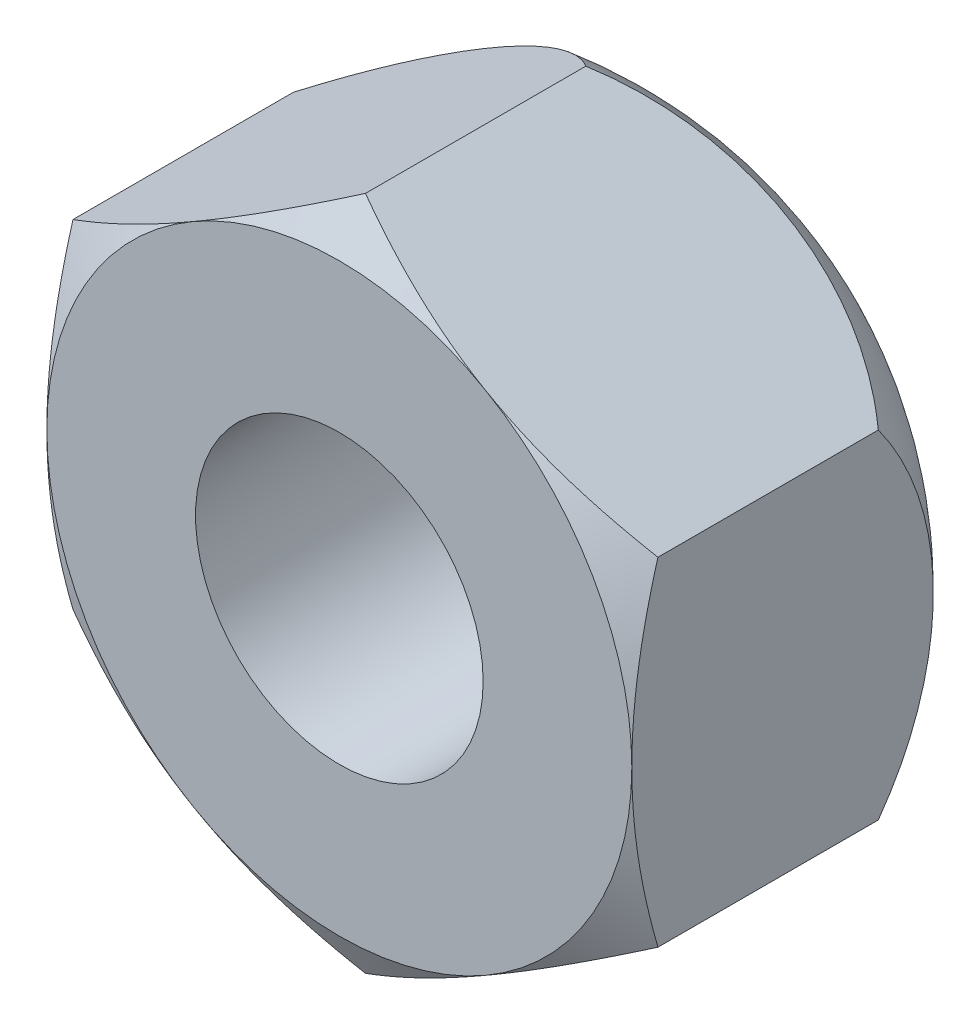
ISO-10303-21;
HEADER;
FILE_DESCRIPTION(('STEP AP214'),'2;1');
FILE_NAME('part.step','',(''),(''),'','','');
FILE_SCHEMA(('AUTOMOTIVE_DESIGN { 1 0 10303 214 1 1 1 1 }'));
ENDSEC;
DATA;
#1=APPLICATION_CONTEXT('core data for automotive mechanical design processes');
#2=APPLICATION_PROTOCOL_DEFINITION('international standard','automotive_design',2000,#1);
#3=PRODUCT_CONTEXT('',#1,'mechanical');
#4=PRODUCT('Part','Part','',(#3));
#5=PRODUCT_RELATED_PRODUCT_CATEGORY('part','',(#4));
#6=PRODUCT_DEFINITION_FORMATION('','',#4);
#7=PRODUCT_DEFINITION_CONTEXT('part definition',#1,'design');
#8=PRODUCT_DEFINITION('design','',#6,#7);
#9=PRODUCT_DEFINITION_SHAPE('','',#8);
#10=(LENGTH_UNIT() NAMED_UNIT(*) SI_UNIT(.MILLI.,.METRE.));
#11=(NAMED_UNIT(*) PLANE_ANGLE_UNIT() SI_UNIT($,.RADIAN.));
#12=(NAMED_UNIT(*) SI_UNIT($,.STERADIAN.) SOLID_ANGLE_UNIT());
#13=UNCERTAINTY_MEASURE_WITH_UNIT(LENGTH_MEASURE(1.E-05),#10,'distance_accuracy_value','');
#14=(GEOMETRIC_REPRESENTATION_CONTEXT(3) GLOBAL_UNCERTAINTY_ASSIGNED_CONTEXT((#13)) GLOBAL_UNIT_ASSIGNED_CONTEXT((#10,
#11,#12)) REPRESENTATION_CONTEXT('',''));
#15=CARTESIAN_POINT('',(0.,0.,0.));
#16=DIRECTION('',(0.,0.,1.));
#17=DIRECTION('',(1.,0.,0.));
#18=AXIS2_PLACEMENT_3D('',#15,#16,#17);
#19=CARTESIAN_POINT('',(28.,26.8301270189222,-46.));
#20=DIRECTION('',(0.500000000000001,0.866025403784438,0.));
#21=DIRECTION('',(-0.866025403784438,0.500000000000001,0.));
#22=AXIS2_PLACEMENT_3D('',#19,#20,#21);
#23=PLANE('',#22);
#24=CARTESIAN_POINT('',(28.000000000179,26.8301270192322,-43.0000000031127));
#25=CARTESIAN_POINT('',(27.8938890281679,26.8913902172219,-42.9999795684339));
#26=CARTESIAN_POINT('',(27.7877831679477,26.9526504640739,-43.0025997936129));
#27=CARTESIAN_POINT('',(27.5757797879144,27.0750506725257,-43.0129696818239));
#28=CARTESIAN_POINT('',(27.4698822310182,27.1361906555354,-43.0207183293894));
#29=CARTESIAN_POINT('',(27.2589794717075,27.2579554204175,-43.0411421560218));
#30=CARTESIAN_POINT('',(27.153972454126,27.3185812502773,-43.0537925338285));
#31=CARTESIAN_POINT('',(26.9444587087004,27.4395440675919,-43.083747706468));
#32=CARTESIAN_POINT('',(26.8399519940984,27.4998810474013,-43.1010526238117));
#33=CARTESIAN_POINT('',(26.5276154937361,27.6802086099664,-43.1594145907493));
#34=CARTESIAN_POINT('',(26.3206930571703,27.799675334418,-43.2069471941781));
#35=CARTESIAN_POINT('',(25.9086276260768,28.0375814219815,-43.3165695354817));
#36=CARTESIAN_POINT('',(25.7034990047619,28.156012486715,-43.3787319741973));
#37=CARTESIAN_POINT('',(25.50000007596,28.2735026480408,-43.4465819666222));
#38=B_SPLINE_CURVE_WITH_KNOTS('',3,(#24,#25,#26,#27,#28,#29,#30,#31,#32,#33,#34,#35,#36,#37),
.UNSPECIFIED.,.F.,.F.,(4,2,2,2,2,2,4),(0.,0.367541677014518,0.735010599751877,1.10064402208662,
1.46628706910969,2.1966148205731,2.93065145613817),.UNSPECIFIED.);
#39=CARTESIAN_POINT('',(27.999999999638,26.8301270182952,-43.0000000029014));
#40=VERTEX_POINT('',#39);
#41=CARTESIAN_POINT('',(25.5000000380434,28.2735026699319,-43.446581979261));
#42=VERTEX_POINT('',#41);
#43=EDGE_CURVE('E166',#40,#42,#38,.T.);
#44=ORIENTED_EDGE('',*,*,#43,.F.);
#45=CARTESIAN_POINT('',(30.5000000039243,25.3867513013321,-43.4465820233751));
#46=CARTESIAN_POINT('',(30.2965010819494,25.5042414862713,-43.3787320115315));
#47=CARTESIAN_POINT('',(30.0913724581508,25.6226725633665,-43.3165695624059));
#48=CARTESIAN_POINT('',(29.6793070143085,25.8605786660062,-43.206947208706));
#49=CARTESIAN_POINT('',(29.4723845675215,25.980045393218,-43.1594146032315));
#50=CARTESIAN_POINT('',(29.1600480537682,26.1603729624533,-43.1010526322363));
#51=CARTESIAN_POINT('',(29.0555413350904,26.2207099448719,-43.0837477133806));
#52=CARTESIAN_POINT('',(28.8460275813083,26.341672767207,-43.0537925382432));
#53=CARTESIAN_POINT('',(28.7410205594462,26.4022985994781,-43.0411421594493));
#54=CARTESIAN_POINT('',(28.5301177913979,26.524063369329,-43.0207183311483));
#55=CARTESIAN_POINT('',(28.4242202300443,26.5852033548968,-43.0129696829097));
#56=CARTESIAN_POINT('',(28.2122168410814,26.707603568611,-43.0025997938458));
#57=CARTESIAN_POINT('',(28.1061109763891,26.7688638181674,-42.9999795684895));
#58=CARTESIAN_POINT('',(27.9999999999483,26.830127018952,-43.0000000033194));
#59=B_SPLINE_CURVE_WITH_KNOTS('',3,(#45,#46,#47,#48,#49,#50,#51,#52,#53,#54,#55,#56,#57,#58),
.UNSPECIFIED.,.F.,.F.,(4,2,2,2,2,2,4),(0.,0.734036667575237,1.46436444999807,1.83000751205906,
2.19564094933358,2.56310988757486,2.93065158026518),.UNSPECIFIED.);
#60=CARTESIAN_POINT('',(30.5,25.3867513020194,-43.446581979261));
#61=VERTEX_POINT('',#60);
#62=EDGE_CURVE('E191',#61,#40,#59,.T.);
#63=ORIENTED_EDGE('',*,*,#62,.F.);
#64=DIRECTION('',(0.,0.,-1.));
#65=VECTOR('',#64,1.);
#66=CARTESIAN_POINT('',(30.5,25.3867513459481,-46.));
#67=LINE('',#66,#65);
#68=CARTESIAN_POINT('',(30.5,25.3867513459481,-47.2135513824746));
#69=VERTEX_POINT('',#68);
#70=EDGE_CURVE('E325',#69,#61,#67,.F.);
#71=ORIENTED_EDGE('',*,*,#70,.F.);
#72=CARTESIAN_POINT('',(25.5,28.2735026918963,-47.2135513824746));
#73=CARTESIAN_POINT('',(25.5963948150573,28.2178491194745,-47.2947487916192));
#74=CARTESIAN_POINT('',(25.6957689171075,28.1604754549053,-47.3712256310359));
#75=CARTESIAN_POINT('',(25.8997346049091,28.0427158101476,-47.5142464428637));
#76=CARTESIAN_POINT('',(26.0043259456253,27.9823299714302,-47.5807908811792));
#77=CARTESIAN_POINT('',(26.2179330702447,27.8590038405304,-47.703427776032));
#78=CARTESIAN_POINT('',(26.3269462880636,27.7960650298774,-47.7595261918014));
#79=CARTESIAN_POINT('',(26.5486751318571,27.6680498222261,-47.8609228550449));
#80=CARTESIAN_POINT('',(26.6613907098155,27.6029734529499,-47.9062212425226));
#81=CARTESIAN_POINT('',(26.8897513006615,27.4711294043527,-47.9857049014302));
#82=CARTESIAN_POINT('',(27.005396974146,27.4043613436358,-48.0198876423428));
#83=CARTESIAN_POINT('',(27.2388143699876,27.2695977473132,-48.0768938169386));
#84=CARTESIAN_POINT('',(27.3565868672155,27.2016017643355,-48.0997130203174));
#85=CARTESIAN_POINT('',(27.5933099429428,27.0649296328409,-48.1338007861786));
#86=CARTESIAN_POINT('',(27.7122598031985,26.9962538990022,-48.1450759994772));
#87=CARTESIAN_POINT('',(27.9506019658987,26.858646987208,-48.1560208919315));
#88=CARTESIAN_POINT('',(28.0699944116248,26.7897157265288,-48.1556864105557));
#89=CARTESIAN_POINT('',(28.3083067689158,26.6521260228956,-48.1434049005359));
#90=CARTESIAN_POINT('',(28.4272267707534,26.5834675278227,-48.1314602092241));
#91=CARTESIAN_POINT('',(28.663820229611,26.4468702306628,-48.0960405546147));
#92=CARTESIAN_POINT('',(28.7814931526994,26.3789317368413,-48.0725608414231));
#93=CARTESIAN_POINT('',(29.0146568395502,26.2443146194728,-48.0142451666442));
#94=CARTESIAN_POINT('',(29.1301486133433,26.1776354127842,-47.9794146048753));
#95=CARTESIAN_POINT('',(29.358187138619,26.0459773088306,-47.8986500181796));
#96=CARTESIAN_POINT('',(29.4707332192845,25.9809987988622,-47.8527134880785));
#97=CARTESIAN_POINT('',(29.7443612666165,25.8230195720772,-47.7257814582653));
#98=CARTESIAN_POINT('',(29.9032997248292,25.7312564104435,-47.6384690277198));
#99=CARTESIAN_POINT('',(30.1335451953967,25.5983241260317,-47.4911107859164));
#100=CARTESIAN_POINT('',(30.2088989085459,25.5548186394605,-47.4392887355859));
#101=CARTESIAN_POINT('',(30.3566949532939,25.4694885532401,-47.3303471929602));
#102=CARTESIAN_POINT('',(30.429136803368,25.4276642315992,-47.2732268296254));
#103=CARTESIAN_POINT('',(30.5,25.3867513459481,-47.2135513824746));
#104=B_SPLINE_CURVE_WITH_KNOTS('',3,(#72,#73,#74,#75,#76,#77,#78,#79,#80,#81,#82,#83,#84,#85,
#86,#87,#88,#89,#90,#91,#92,#93,#94,#95,#96,#97,#98,#99,#100,#101,#102,#103),.UNSPECIFIED.,.F.,
.F.,(4,2,2,2,2,2,2,2,2,2,2,2,2,2,2,4),(0.,0.413202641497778,0.826385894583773,1.23933270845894,
1.6522741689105,2.065309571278,2.47849861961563,2.89144948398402,3.30454833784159,
3.71756404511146,4.13074996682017,4.54373961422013,4.95682250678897,5.5647299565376,
5.86839066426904,6.17210138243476),.UNSPECIFIED.);
#105=CARTESIAN_POINT('',(25.5,28.2735026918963,-47.2135513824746));
#106=VERTEX_POINT('',#105);
#107=EDGE_CURVE('E125',#106,#69,#104,.T.);
#108=ORIENTED_EDGE('',*,*,#107,.F.);
#109=DIRECTION('',(0.,0.,1.));
#110=VECTOR('',#109,1.);
#111=CARTESIAN_POINT('',(25.5,28.2735026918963,-46.));
#112=LINE('',#111,#110);
#113=EDGE_CURVE('E124',#42,#106,#112,.F.);
#114=ORIENTED_EDGE('',*,*,#113,.F.);
#115=EDGE_LOOP('',(#44,#63,#71,#108,#114));
#116=FACE_BOUND('',#115,.T.);
#117=ADVANCED_FACE('F16',(#116),#23,.T.);
#118=CARTESIAN_POINT('',(30.5,22.5,-46.));
#119=DIRECTION('',(1.,0.,0.));
#120=DIRECTION('',(0.,0.,-1.));
#121=AXIS2_PLACEMENT_3D('',#118,#119,#120);
#122=PLANE('',#121);
#123=CARTESIAN_POINT('',(30.500000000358,22.5,-43.0000000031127));
#124=CARTESIAN_POINT('',(30.5000000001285,22.6225263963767,-42.9999795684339));
#125=CARTESIAN_POINT('',(30.5000000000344,22.7450468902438,-43.0025997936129));
#126=CARTESIAN_POINT('',(30.4999999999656,22.9898473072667,-43.0129696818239));
#127=CARTESIAN_POINT('',(30.4999999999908,23.1121272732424,-43.0207183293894));
#128=CARTESIAN_POINT('',(30.5000000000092,23.3556568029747,-43.0411421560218));
#129=CARTESIAN_POINT('',(30.5000000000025,23.4769084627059,-43.0537925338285));
#130=CARTESIAN_POINT('',(30.4999999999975,23.7188340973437,-43.083747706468));
#131=CARTESIAN_POINT('',(30.4999999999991,23.8395080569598,-43.1010526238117));
#132=CARTESIAN_POINT('',(30.5000000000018,24.2001631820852,-43.1594145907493));
#133=CARTESIAN_POINT('',(30.5000000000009,24.43909663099,-43.2069471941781));
#134=CARTESIAN_POINT('',(30.4999999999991,24.9149088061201,-43.3165695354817));
#135=CARTESIAN_POINT('',(30.4999999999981,25.1517709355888,-43.3787319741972));
#136=CARTESIAN_POINT('',(30.5,25.3867512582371,-43.4465819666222));
#137=B_SPLINE_CURVE_WITH_KNOTS('',3,(#123,#124,#125,#126,#127,#128,#129,#130,#131,#132,#133,
#134,#135,#136),.UNSPECIFIED.,.F.,.F.,(4,2,2,2,2,2,4),(0.,0.367541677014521,0.735010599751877,
1.10064402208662,1.46628706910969,2.19661482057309,2.93065145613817),.UNSPECIFIED.);
#138=CARTESIAN_POINT('',(30.499999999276,22.5,-43.0000000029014));
#139=VERTEX_POINT('',#138);
#140=EDGE_CURVE('E165',#139,#61,#137,.T.);
#141=ORIENTED_EDGE('',*,*,#140,.F.);
#142=CARTESIAN_POINT('',(30.4999999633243,19.6132486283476,-43.4465820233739));
#143=CARTESIAN_POINT('',(30.499999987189,19.8482289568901,-43.3787320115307));
#144=CARTESIAN_POINT('',(30.4999999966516,20.0850910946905,-43.3165695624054));
#145=CARTESIAN_POINT('',(30.5000000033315,20.5609032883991,-43.2069472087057));
#146=CARTESIAN_POINT('',(30.5000000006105,20.7998367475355,-43.1594146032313));
#147=CARTESIAN_POINT('',(30.4999999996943,21.1604918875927,-43.1010526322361));
#148=CARTESIAN_POINT('',(30.4999999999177,21.2811658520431,-43.0837477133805));
#149=CARTESIAN_POINT('',(30.5000000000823,21.523091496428,-43.0537925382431));
#150=CARTESIAN_POINT('',(30.5000000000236,21.6443431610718,-43.0411421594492));
#151=CARTESIAN_POINT('',(30.4999999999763,21.8878727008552,-43.0207183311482));
#152=CARTESIAN_POINT('',(30.4999999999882,22.0101526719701,-43.0129696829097));
#153=CARTESIAN_POINT('',(30.5000000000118,22.2549530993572,-43.0025997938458));
#154=CARTESIAN_POINT('',(30.5000000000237,22.3774735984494,-42.9999795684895));
#155=CARTESIAN_POINT('',(30.5,22.5000000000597,-43.0000000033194));
#156=B_SPLINE_CURVE_WITH_KNOTS('',3,(#142,#143,#144,#145,#146,#147,#148,#149,#150,#151,#152,
#153,#154,#155),.UNSPECIFIED.,.F.,.F.,(4,2,2,2,2,2,4),(0.,0.734036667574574,1.46436444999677,
1.83000751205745,2.19564094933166,2.56310988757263,2.93065158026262),.UNSPECIFIED.);
#157=CARTESIAN_POINT('',(30.4999999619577,19.6132486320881,-43.4465819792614));
#158=VERTEX_POINT('',#157);
#159=EDGE_CURVE('E213',#158,#139,#156,.T.);
#160=ORIENTED_EDGE('',*,*,#159,.F.);
#161=DIRECTION('',(0.,0.,1.));
#162=VECTOR('',#161,1.);
#163=CARTESIAN_POINT('',(30.5,19.6132486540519,-46.));
#164=LINE('',#163,#162);
#165=CARTESIAN_POINT('',(30.5,19.6132486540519,-47.2135513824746));
#166=VERTEX_POINT('',#165);
#167=EDGE_CURVE('E271',#166,#158,#164,.T.);
#168=ORIENTED_EDGE('',*,*,#167,.F.);
#169=CARTESIAN_POINT('',(30.5,22.5,-43.255437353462));
#170=DIRECTION('',(1.,0.,0.));
#171=DIRECTION('',(0.,0.,-1.));
#172=AXIS2_PLACEMENT_3D('',#169,#170,#171);
#173=CIRCLE('',#172,4.89897948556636);
#174=EDGE_CURVE('E126',#69,#166,#173,.F.);
#175=ORIENTED_EDGE('',*,*,#174,.F.);
#176=ORIENTED_EDGE('',*,*,#70,.T.);
#177=EDGE_LOOP('',(#141,#160,#168,#175,#176));
#178=FACE_BOUND('',#177,.T.);
#179=ADVANCED_FACE('F203',(#178),#122,.T.);
#180=CARTESIAN_POINT('',(28.,18.1698729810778,-46.));
#181=DIRECTION('',(0.500000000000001,-0.866025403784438,0.));
#182=DIRECTION('',(0.866025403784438,0.500000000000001,0.));
#183=AXIS2_PLACEMENT_3D('',#180,#181,#182);
#184=PLANE('',#183);
#185=CARTESIAN_POINT('',(28.000000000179,18.1698729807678,-43.0000000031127));
#186=CARTESIAN_POINT('',(28.1061109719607,18.2311361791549,-42.9999795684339));
#187=CARTESIAN_POINT('',(28.2122168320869,18.29239642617,-43.0025997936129));
#188=CARTESIAN_POINT('',(28.4242202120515,18.4147966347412,-43.012969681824));
#189=CARTESIAN_POINT('',(28.530117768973,18.4759366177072,-43.0207183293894));
#190=CARTESIAN_POINT('',(28.7410205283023,18.5977013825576,-43.0411421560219));
#191=CARTESIAN_POINT('',(28.8460275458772,18.658327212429,-43.0537925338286));
#192=CARTESIAN_POINT('',(29.0555412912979,18.7792900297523,-43.0837477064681));
#193=CARTESIAN_POINT('',(29.1600480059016,18.8396270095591,-43.1010526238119));
#194=CARTESIAN_POINT('',(29.4723845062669,19.0199545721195,-43.1594145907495));
#195=CARTESIAN_POINT('',(29.679306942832,19.1394212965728,-43.2069471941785));
#196=CARTESIAN_POINT('',(30.091372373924,19.3773273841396,-43.3165695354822));
#197=CARTESIAN_POINT('',(30.2965009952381,19.4957584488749,-43.3787319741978));
#198=CARTESIAN_POINT('',(30.499999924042,19.6132486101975,-43.4465819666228));
#199=B_SPLINE_CURVE_WITH_KNOTS('',3,(#185,#186,#187,#188,#189,#190,#191,#192,#193,#194,#195,
#196,#197,#198),.UNSPECIFIED.,.F.,.F.,(4,2,2,2,2,2,4),(0.,0.367541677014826,0.735010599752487,
1.10064402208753,1.4662870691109,2.1966148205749,2.93065145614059),.UNSPECIFIED.);
#200=CARTESIAN_POINT('',(27.999999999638,18.1698729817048,-43.0000000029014));
#201=VERTEX_POINT('',#200);
#202=EDGE_CURVE('E196',#201,#158,#199,.T.);
#203=ORIENTED_EDGE('',*,*,#202,.F.);
#204=CARTESIAN_POINT('',(25.499999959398,16.7264973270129,-43.4465820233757));
#205=CARTESIAN_POINT('',(25.7034989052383,16.8439874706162,-43.3787320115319));
#206=CARTESIAN_POINT('',(25.9086275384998,16.9624185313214,-43.3165695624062));
#207=CARTESIAN_POINT('',(26.3206929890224,17.2003246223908,-43.2069472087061));
#208=CARTESIAN_POINT('',(26.5276154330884,17.3197913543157,-43.1594146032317));
#209=CARTESIAN_POINT('',(26.8399519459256,17.500118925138,-43.1010526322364));
#210=CARTESIAN_POINT('',(26.9444586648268,17.5604559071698,-43.0837477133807));
#211=CARTESIAN_POINT('',(27.1539724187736,17.6814187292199,-43.0537925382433));
#212=CARTESIAN_POINT('',(27.2589794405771,17.7420445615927,-43.0411421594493));
#213=CARTESIAN_POINT('',(27.4698822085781,17.8638093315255,-43.0207183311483));
#214=CARTESIAN_POINT('',(27.5757797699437,17.9249493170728,-43.0129696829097));
#215=CARTESIAN_POINT('',(27.7877831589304,18.047349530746,-43.0025997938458));
#216=CARTESIAN_POINT('',(27.8938890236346,18.1086097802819,-42.9999795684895));
#217=CARTESIAN_POINT('',(28.0000000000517,18.1698729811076,-43.0000000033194));
#218=B_SPLINE_CURVE_WITH_KNOTS('',3,(#204,#205,#206,#207,#208,#209,#210,#211,#212,#213,#214,
#215,#216,#217),.UNSPECIFIED.,.F.,.F.,(4,2,2,2,2,2,4),(0.,0.734036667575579,1.46436444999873,
1.83000751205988,2.19564094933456,2.56310988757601,2.9306515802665),.UNSPECIFIED.);
#219=CARTESIAN_POINT('',(25.499999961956,16.7264973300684,-43.4465819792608));
#220=VERTEX_POINT('',#219);
#221=EDGE_CURVE('E225',#220,#201,#218,.T.);
#222=ORIENTED_EDGE('',*,*,#221,.F.);
#223=DIRECTION('',(0.,0.,1.));
#224=VECTOR('',#223,1.);
#225=CARTESIAN_POINT('',(25.5,16.7264973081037,-46.));
#226=LINE('',#225,#224);
#227=CARTESIAN_POINT('',(25.5,16.7264973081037,-47.2135513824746));
#228=VERTEX_POINT('',#227);
#229=EDGE_CURVE('E322',#228,#220,#226,.T.);
#230=ORIENTED_EDGE('',*,*,#229,.F.);
#231=CARTESIAN_POINT('',(30.5,19.6132486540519,-47.2135513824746));
#232=CARTESIAN_POINT('',(30.4036051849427,19.5575950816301,-47.2947487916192));
#233=CARTESIAN_POINT('',(30.3042310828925,19.5002214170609,-47.3712256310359));
#234=CARTESIAN_POINT('',(30.100265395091,19.3824617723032,-47.5142464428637));
#235=CARTESIAN_POINT('',(29.9956740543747,19.3220759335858,-47.5807908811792));
#236=CARTESIAN_POINT('',(29.7820669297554,19.198749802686,-47.7034277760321));
#237=CARTESIAN_POINT('',(29.6730537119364,19.135810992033,-47.7595261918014));
#238=CARTESIAN_POINT('',(29.4513248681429,19.0077957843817,-47.8609228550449));
#239=CARTESIAN_POINT('',(29.3386092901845,18.9427194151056,-47.9062212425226));
#240=CARTESIAN_POINT('',(29.1102486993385,18.8108753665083,-47.9857049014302));
#241=CARTESIAN_POINT('',(28.994603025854,18.7441073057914,-48.0198876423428));
#242=CARTESIAN_POINT('',(28.7611856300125,18.6093437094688,-48.0768938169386));
#243=CARTESIAN_POINT('',(28.6434131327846,18.5413477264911,-48.0997130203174));
#244=CARTESIAN_POINT('',(28.4066900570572,18.4046755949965,-48.1338007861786));
#245=CARTESIAN_POINT('',(28.2877401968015,18.3359998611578,-48.1450759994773));
#246=CARTESIAN_POINT('',(28.0493980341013,18.1983929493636,-48.1560208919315));
#247=CARTESIAN_POINT('',(27.9300055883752,18.1294616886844,-48.1556864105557));
#248=CARTESIAN_POINT('',(27.6916932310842,17.9918719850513,-48.1434049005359));
#249=CARTESIAN_POINT('',(27.5727732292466,17.9232134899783,-48.1314602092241));
#250=CARTESIAN_POINT('',(27.336179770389,17.7866161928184,-48.0960405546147));
#251=CARTESIAN_POINT('',(27.2185068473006,17.7186776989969,-48.0725608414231));
#252=CARTESIAN_POINT('',(26.9853431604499,17.5840605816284,-48.0142451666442));
#253=CARTESIAN_POINT('',(26.8698513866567,17.5173813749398,-47.9794146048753));
#254=CARTESIAN_POINT('',(26.641812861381,17.3857232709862,-47.8986500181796));
#255=CARTESIAN_POINT('',(26.5292667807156,17.3207447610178,-47.8527134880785));
#256=CARTESIAN_POINT('',(26.2556387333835,17.1627655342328,-47.7257814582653));
#257=CARTESIAN_POINT('',(26.0967002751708,17.0710023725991,-47.6384690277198));
#258=CARTESIAN_POINT('',(25.8664548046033,16.9380700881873,-47.4911107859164));
#259=CARTESIAN_POINT('',(25.7911010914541,16.8945646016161,-47.4392887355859));
#260=CARTESIAN_POINT('',(25.6433050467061,16.8092345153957,-47.3303471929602));
#261=CARTESIAN_POINT('',(25.570863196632,16.7674101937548,-47.2732268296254));
#262=CARTESIAN_POINT('',(25.5,16.7264973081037,-47.2135513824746));
#263=B_SPLINE_CURVE_WITH_KNOTS('',3,(#231,#232,#233,#234,#235,#236,#237,#238,#239,#240,#241,
#242,#243,#244,#245,#246,#247,#248,#249,#250,#251,#252,#253,#254,#255,#256,#257,#258,#259,#260,
#261,#262),.UNSPECIFIED.,.F.,.F.,(4,2,2,2,2,2,2,2,2,2,2,2,2,2,2,4),(0.,0.413202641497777,
0.826385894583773,1.23933270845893,1.65227416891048,2.06530957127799,2.47849861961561,
2.891449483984,3.30454833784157,3.71756404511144,4.13074996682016,4.54373961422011,
4.95682250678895,5.5647299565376,5.86839066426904,6.17210138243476),.UNSPECIFIED.);
#264=EDGE_CURVE('E413',#166,#228,#263,.T.);
#265=ORIENTED_EDGE('',*,*,#264,.F.);
#266=ORIENTED_EDGE('',*,*,#167,.T.);
#267=EDGE_LOOP('',(#203,#222,#230,#265,#266));
#268=FACE_BOUND('',#267,.T.);
#269=ADVANCED_FACE('F209',(#268),#184,.T.);
#270=CARTESIAN_POINT('',(23.,18.1698729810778,-46.));
#271=DIRECTION('',(-0.500000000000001,-0.866025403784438,0.));
#272=DIRECTION('',(0.866025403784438,-0.500000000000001,0.));
#273=AXIS2_PLACEMENT_3D('',#270,#271,#272);
#274=PLANE('',#273);
#275=CARTESIAN_POINT('',(25.5,16.7264973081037,-47.2135513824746));
#276=CARTESIAN_POINT('',(25.4036051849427,16.7821508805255,-47.2947487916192));
#277=CARTESIAN_POINT('',(25.3042310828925,16.8395245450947,-47.3712256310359));
#278=CARTESIAN_POINT('',(25.100265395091,16.9572841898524,-47.5142464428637));
#279=CARTESIAN_POINT('',(24.9956740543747,17.0176700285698,-47.5807908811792));
#280=CARTESIAN_POINT('',(24.7820669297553,17.1409961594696,-47.703427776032));
#281=CARTESIAN_POINT('',(24.6730537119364,17.2039349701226,-47.7595261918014));
#282=CARTESIAN_POINT('',(24.4513248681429,17.3319501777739,-47.8609228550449));
#283=CARTESIAN_POINT('',(24.3386092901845,17.3970265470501,-47.9062212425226));
#284=CARTESIAN_POINT('',(24.1102486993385,17.5288705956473,-47.9857049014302));
#285=CARTESIAN_POINT('',(23.994603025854,17.5956386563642,-48.0198876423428));
#286=CARTESIAN_POINT('',(23.7611856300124,17.7304022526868,-48.0768938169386));
#287=CARTESIAN_POINT('',(23.6434131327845,17.7983982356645,-48.0997130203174));
#288=CARTESIAN_POINT('',(23.4066900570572,17.9350703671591,-48.1338007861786));
#289=CARTESIAN_POINT('',(23.2877401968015,18.0037461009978,-48.1450759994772));
#290=CARTESIAN_POINT('',(23.0493980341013,18.141353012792,-48.1560208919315));
#291=CARTESIAN_POINT('',(22.9300055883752,18.2102842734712,-48.1556864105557));
#292=CARTESIAN_POINT('',(22.6916932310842,18.3478739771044,-48.1434049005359));
#293=CARTESIAN_POINT('',(22.5727732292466,18.4165324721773,-48.1314602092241));
#294=CARTESIAN_POINT('',(22.336179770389,18.5531297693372,-48.0960405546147));
#295=CARTESIAN_POINT('',(22.2185068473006,18.6210682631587,-48.0725608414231));
#296=CARTESIAN_POINT('',(21.9853431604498,18.7556853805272,-48.0142451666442));
#297=CARTESIAN_POINT('',(21.8698513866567,18.8223645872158,-47.9794146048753));
#298=CARTESIAN_POINT('',(21.641812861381,18.9540226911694,-47.8986500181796));
#299=CARTESIAN_POINT('',(21.5292667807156,19.0190012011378,-47.8527134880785));
#300=CARTESIAN_POINT('',(21.2556387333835,19.1769804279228,-47.7257814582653));
#301=CARTESIAN_POINT('',(21.0967002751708,19.2687435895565,-47.6384690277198));
#302=CARTESIAN_POINT('',(20.8664548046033,19.4016758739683,-47.4911107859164));
#303=CARTESIAN_POINT('',(20.7911010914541,19.4451813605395,-47.4392887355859));
#304=CARTESIAN_POINT('',(20.6433050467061,19.5305114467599,-47.3303471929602));
#305=CARTESIAN_POINT('',(20.570863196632,19.5723357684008,-47.2732268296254));
#306=CARTESIAN_POINT('',(20.5,19.6132486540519,-47.2135513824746));
#307=B_SPLINE_CURVE_WITH_KNOTS('',3,(#275,#276,#277,#278,#279,#280,#281,#282,#283,#284,#285,
#286,#287,#288,#289,#290,#291,#292,#293,#294,#295,#296,#297,#298,#299,#300,#301,#302,#303,#304,
#305,#306),.UNSPECIFIED.,.F.,.F.,(4,2,2,2,2,2,2,2,2,2,2,2,2,2,2,4),(0.,0.413202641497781,
0.826385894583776,1.23933270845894,1.65227416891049,2.065309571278,2.47849861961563,
2.89144948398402,3.30454833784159,3.71756404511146,4.13074996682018,4.54373961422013,
4.95682250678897,5.56472995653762,5.86839066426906,6.17210138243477),.UNSPECIFIED.);
#308=CARTESIAN_POINT('',(20.5,19.6132486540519,-47.2135513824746));
#309=VERTEX_POINT('',#308);
#310=EDGE_CURVE('E119',#228,#309,#307,.T.);
#311=ORIENTED_EDGE('',*,*,#310,.F.);
#312=ORIENTED_EDGE('',*,*,#229,.T.);
#313=CARTESIAN_POINT('',(22.999999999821,18.1698729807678,-43.0000000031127));
#314=CARTESIAN_POINT('',(23.1061109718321,18.1086097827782,-42.9999795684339));
#315=CARTESIAN_POINT('',(23.2122168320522,18.0473495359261,-43.0025997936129));
#316=CARTESIAN_POINT('',(23.4242202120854,17.9249493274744,-43.0129696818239));
#317=CARTESIAN_POINT('',(23.5301177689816,17.8638093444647,-43.0207183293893));
#318=CARTESIAN_POINT('',(23.7410205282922,17.7420445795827,-43.0411421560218));
#319=CARTESIAN_POINT('',(23.8460275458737,17.6814187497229,-43.0537925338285));
#320=CARTESIAN_POINT('',(24.0555412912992,17.5604559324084,-43.0837477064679));
#321=CARTESIAN_POINT('',(24.1600480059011,17.500118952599,-43.1010526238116));
#322=CARTESIAN_POINT('',(24.4723845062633,17.319791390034,-43.1594145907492));
#323=CARTESIAN_POINT('',(24.679306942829,17.2003246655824,-43.206947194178));
#324=CARTESIAN_POINT('',(25.0913723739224,16.962418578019,-43.3165695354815));
#325=CARTESIAN_POINT('',(25.2965009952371,16.8439875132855,-43.378731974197));
#326=CARTESIAN_POINT('',(25.499999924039,16.7264973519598,-43.4465819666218));
#327=B_SPLINE_CURVE_WITH_KNOTS('',3,(#313,#314,#315,#316,#317,#318,#319,#320,#321,#322,#323,
#324,#325,#326),.UNSPECIFIED.,.F.,.F.,(4,2,2,2,2,2,4),(0.,0.367541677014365,0.735010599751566,
1.10064402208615,1.46628706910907,2.19661482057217,2.93065145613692),.UNSPECIFIED.);
#328=CARTESIAN_POINT('',(23.000000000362,18.1698729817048,-43.0000000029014));
#329=VERTEX_POINT('',#328);
#330=EDGE_CURVE('E218',#329,#220,#327,.T.);
#331=ORIENTED_EDGE('',*,*,#330,.F.);
#332=CARTESIAN_POINT('',(20.5000000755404,19.6132486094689,-43.4465819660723));
#333=CARTESIAN_POINT('',(20.7034990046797,19.4957584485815,-43.3787319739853));
#334=CARTESIAN_POINT('',(20.9086276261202,19.3773273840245,-43.3165695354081));
#335=CARTESIAN_POINT('',(21.3206930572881,19.1394212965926,-43.2069471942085));
#336=CARTESIAN_POINT('',(21.5276154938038,19.019954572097,-43.1594145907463));
#337=CARTESIAN_POINT('',(21.8399519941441,18.8396270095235,-43.1010526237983));
#338=CARTESIAN_POINT('',(21.9444587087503,18.7792900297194,-43.0837477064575));
#339=CARTESIAN_POINT('',(22.1539724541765,18.658327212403,-43.0537925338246));
#340=CARTESIAN_POINT('',(22.2589794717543,18.5977013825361,-43.0411421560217));
#341=CARTESIAN_POINT('',(22.469882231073,18.4759366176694,-43.0207183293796));
#342=CARTESIAN_POINT('',(22.575779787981,18.4147966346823,-43.0129696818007));
#343=CARTESIAN_POINT('',(22.7877831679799,18.2923964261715,-43.0025997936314));
#344=CARTESIAN_POINT('',(22.8938890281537,18.2311361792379,-42.9999795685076));
#345=CARTESIAN_POINT('',(23.0000000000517,18.169872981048,-43.0000000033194));
#346=B_SPLINE_CURVE_WITH_KNOTS('',3,(#332,#333,#334,#335,#336,#337,#338,#339,#340,#341,#342,
#343,#344,#345),.UNSPECIFIED.,.F.,.F.,(4,2,2,2,2,2,4),(0.,0.734036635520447,1.46436438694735,
1.83000743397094,2.19564085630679,2.56310977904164,2.93065145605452),.UNSPECIFIED.);
#347=CARTESIAN_POINT('',(20.5,19.6132486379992,-43.4465819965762));
#348=VERTEX_POINT('',#347);
#349=EDGE_CURVE('E248',#348,#329,#346,.T.);
#350=ORIENTED_EDGE('',*,*,#349,.F.);
#351=DIRECTION('',(0.,0.,1.));
#352=VECTOR('',#351,1.);
#353=CARTESIAN_POINT('',(20.5,19.6132486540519,-46.));
#354=LINE('',#353,#352);
#355=EDGE_CURVE('E97',#309,#348,#354,.T.);
#356=ORIENTED_EDGE('',*,*,#355,.F.);
#357=EDGE_LOOP('',(#311,#312,#331,#350,#356));
#358=FACE_BOUND('',#357,.T.);
#359=ADVANCED_FACE('F144',(#358),#274,.T.);
#360=CARTESIAN_POINT('',(23.,26.8301270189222,-46.));
#361=DIRECTION('',(-0.500000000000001,0.866025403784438,0.));
#362=DIRECTION('',(-0.866025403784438,-0.500000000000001,0.));
#363=AXIS2_PLACEMENT_3D('',#360,#361,#362);
#364=PLANE('',#363);
#365=CARTESIAN_POINT('',(22.999999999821,26.8301270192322,-43.0000000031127));
#366=CARTESIAN_POINT('',(22.8938890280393,26.7688638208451,-42.9999795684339));
#367=CARTESIAN_POINT('',(22.7877831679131,26.7076035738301,-43.0025997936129));
#368=CARTESIAN_POINT('',(22.5757797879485,26.5852033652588,-43.012969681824));
#369=CARTESIAN_POINT('',(22.469882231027,26.5240633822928,-43.0207183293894));
#370=CARTESIAN_POINT('',(22.2589794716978,26.4022986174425,-43.0411421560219));
#371=CARTESIAN_POINT('',(22.1539724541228,26.3416727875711,-43.0537925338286));
#372=CARTESIAN_POINT('',(21.9444587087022,26.2207099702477,-43.0837477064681));
#373=CARTESIAN_POINT('',(21.8399519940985,26.160372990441,-43.1010526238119));
#374=CARTESIAN_POINT('',(21.5276154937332,25.9800454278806,-43.1594145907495));
#375=CARTESIAN_POINT('',(21.3206930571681,25.8605787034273,-43.2069471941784));
#376=CARTESIAN_POINT('',(20.9086276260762,25.6226726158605,-43.3165695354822));
#377=CARTESIAN_POINT('',(20.7034990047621,25.5042415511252,-43.3787319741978));
#378=CARTESIAN_POINT('',(20.5000000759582,25.3867513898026,-43.4465819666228));
#379=B_SPLINE_CURVE_WITH_KNOTS('',3,(#365,#366,#367,#368,#369,#370,#371,#372,#373,#374,#375,
#376,#377,#378),.UNSPECIFIED.,.F.,.F.,(4,2,2,2,2,2,4),(0.,0.36754167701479,0.735010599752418,
1.10064402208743,1.46628706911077,2.19661482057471,2.93065145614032),.UNSPECIFIED.);
#380=CARTESIAN_POINT('',(23.000000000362,26.8301270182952,-43.0000000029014));
#381=VERTEX_POINT('',#380);
#382=CARTESIAN_POINT('',(20.5000000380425,25.386751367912,-43.4465819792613));
#383=VERTEX_POINT('',#382);
#384=EDGE_CURVE('E151',#381,#383,#379,.T.);
#385=ORIENTED_EDGE('',*,*,#384,.F.);
#386=CARTESIAN_POINT('',(25.5000000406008,28.2735026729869,-43.4465820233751));
#387=CARTESIAN_POINT('',(25.2965010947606,28.1560125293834,-43.3787320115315));
#388=CARTESIAN_POINT('',(25.0913724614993,28.0375814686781,-43.3165695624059));
#389=CARTESIAN_POINT('',(24.6793070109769,27.7996753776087,-43.206947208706));
#390=CARTESIAN_POINT('',(24.472384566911,27.6802086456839,-43.1594146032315));
#391=CARTESIAN_POINT('',(24.1600480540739,27.4998810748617,-43.1010526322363));
#392=CARTESIAN_POINT('',(24.0555413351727,27.4395440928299,-43.0837477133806));
#393=CARTESIAN_POINT('',(23.846027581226,27.3185812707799,-43.0537925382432));
#394=CARTESIAN_POINT('',(23.7410205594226,27.2579554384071,-43.0411421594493));
#395=CARTESIAN_POINT('',(23.5301177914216,27.1361906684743,-43.0207183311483));
#396=CARTESIAN_POINT('',(23.4242202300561,27.0750506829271,-43.0129696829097));
#397=CARTESIAN_POINT('',(23.2122168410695,26.952650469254,-43.0025997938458));
#398=CARTESIAN_POINT('',(23.1061109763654,26.8913902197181,-42.9999795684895));
#399=CARTESIAN_POINT('',(22.9999999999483,26.8301270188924,-43.0000000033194));
#400=B_SPLINE_CURVE_WITH_KNOTS('',3,(#386,#387,#388,#389,#390,#391,#392,#393,#394,#395,#396,
#397,#398,#399),.UNSPECIFIED.,.F.,.F.,(4,2,2,2,2,2,4),(0.,0.734036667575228,1.46436444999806,
1.83000751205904,2.19564094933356,2.56310988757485,2.93065158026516),.UNSPECIFIED.);
#401=EDGE_CURVE('E159',#42,#381,#400,.T.);
#402=ORIENTED_EDGE('',*,*,#401,.F.);
#403=ORIENTED_EDGE('',*,*,#113,.T.);
#404=CARTESIAN_POINT('',(20.5,25.3867513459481,-47.2135513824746));
#405=CARTESIAN_POINT('',(20.5963948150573,25.4424049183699,-47.2947487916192));
#406=CARTESIAN_POINT('',(20.6957689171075,25.4997785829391,-47.3712256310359));
#407=CARTESIAN_POINT('',(20.899734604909,25.6175382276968,-47.5142464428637));
#408=CARTESIAN_POINT('',(21.0043259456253,25.6779240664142,-47.5807908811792));
#409=CARTESIAN_POINT('',(21.2179330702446,25.801250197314,-47.703427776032));
#410=CARTESIAN_POINT('',(21.3269462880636,25.864189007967,-47.7595261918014));
#411=CARTESIAN_POINT('',(21.5486751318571,25.9922042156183,-47.8609228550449));
#412=CARTESIAN_POINT('',(21.6613907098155,26.0572805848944,-47.9062212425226));
#413=CARTESIAN_POINT('',(21.8897513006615,26.1891246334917,-47.9857049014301));
#414=CARTESIAN_POINT('',(22.005396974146,26.2558926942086,-48.0198876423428));
#415=CARTESIAN_POINT('',(22.2388143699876,26.3906562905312,-48.0768938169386));
#416=CARTESIAN_POINT('',(22.3565868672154,26.4586522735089,-48.0997130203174));
#417=CARTESIAN_POINT('',(22.5933099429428,26.5953244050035,-48.1338007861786));
#418=CARTESIAN_POINT('',(22.7122598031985,26.6640001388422,-48.1450759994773));
#419=CARTESIAN_POINT('',(22.9506019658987,26.8016070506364,-48.1560208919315));
#420=CARTESIAN_POINT('',(23.0699944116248,26.8705383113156,-48.1556864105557));
#421=CARTESIAN_POINT('',(23.3083067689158,27.0081280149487,-48.1434049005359));
#422=CARTESIAN_POINT('',(23.4272267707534,27.0767865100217,-48.1314602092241));
#423=CARTESIAN_POINT('',(23.663820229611,27.2133838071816,-48.0960405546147));
#424=CARTESIAN_POINT('',(23.7814931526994,27.2813223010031,-48.0725608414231));
#425=CARTESIAN_POINT('',(24.0146568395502,27.4159394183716,-48.0142451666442));
#426=CARTESIAN_POINT('',(24.1301486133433,27.4826186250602,-47.9794146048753));
#427=CARTESIAN_POINT('',(24.358187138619,27.6142767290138,-47.8986500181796));
#428=CARTESIAN_POINT('',(24.4707332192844,27.6792552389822,-47.8527134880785));
#429=CARTESIAN_POINT('',(24.7443612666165,27.8372344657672,-47.7257814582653));
#430=CARTESIAN_POINT('',(24.9032997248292,27.9289976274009,-47.6384690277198));
#431=CARTESIAN_POINT('',(25.1335451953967,28.0619299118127,-47.4911107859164));
#432=CARTESIAN_POINT('',(25.2088989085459,28.1054353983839,-47.4392887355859));
#433=CARTESIAN_POINT('',(25.3566949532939,28.1907654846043,-47.3303471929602));
#434=CARTESIAN_POINT('',(25.429136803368,28.2325898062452,-47.2732268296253));
#435=CARTESIAN_POINT('',(25.5,28.2735026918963,-47.2135513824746));
#436=B_SPLINE_CURVE_WITH_KNOTS('',3,(#404,#405,#406,#407,#408,#409,#410,#411,#412,#413,#414,
#415,#416,#417,#418,#419,#420,#421,#422,#423,#424,#425,#426,#427,#428,#429,#430,#431,#432,#433,
#434,#435),.UNSPECIFIED.,.F.,.F.,(4,2,2,2,2,2,2,2,2,2,2,2,2,2,2,4),(0.,0.413202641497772,
0.826385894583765,1.23933270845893,1.65227416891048,2.06530957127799,2.47849861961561,
2.891449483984,3.30454833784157,3.71756404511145,4.13074996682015,4.54373961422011,
4.95682250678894,5.56472995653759,5.86839066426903,6.17210138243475),.UNSPECIFIED.);
#437=CARTESIAN_POINT('',(20.5,25.3867513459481,-47.2135513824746));
#438=VERTEX_POINT('',#437);
#439=EDGE_CURVE('E117',#438,#106,#436,.T.);
#440=ORIENTED_EDGE('',*,*,#439,.F.);
#441=DIRECTION('',(0.,0.,1.));
#442=VECTOR('',#441,1.);
#443=CARTESIAN_POINT('',(20.5,25.3867513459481,-46.));
#444=LINE('',#443,#442);
#445=EDGE_CURVE('E104',#383,#438,#444,.F.);
#446=ORIENTED_EDGE('',*,*,#445,.F.);
#447=EDGE_LOOP('',(#385,#402,#403,#440,#446));
#448=FACE_BOUND('',#447,.T.);
#449=ADVANCED_FACE('F121',(#448),#364,.T.);
#450=CARTESIAN_POINT('',(20.5,22.5,-46.));
#451=DIRECTION('',(-1.,0.,0.));
#452=DIRECTION('',(0.,0.,1.));
#453=AXIS2_PLACEMENT_3D('',#450,#451,#452);
#454=PLANE('',#453);
#455=ORIENTED_EDGE('',*,*,#445,.T.);
#456=CARTESIAN_POINT('',(20.5,22.5,-43.255437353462));
#457=DIRECTION('',(1.,0.,0.));
#458=DIRECTION('',(0.,0.,-1.));
#459=AXIS2_PLACEMENT_3D('',#456,#457,#458);
#460=CIRCLE('',#459,4.89897948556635);
#461=EDGE_CURVE('E20',#309,#438,#460,.T.);
#462=ORIENTED_EDGE('',*,*,#461,.F.);
#463=ORIENTED_EDGE('',*,*,#355,.T.);
#464=CARTESIAN_POINT('',(20.499999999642,22.5,-43.0000000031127));
#465=CARTESIAN_POINT('',(20.4999999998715,22.3774735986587,-42.9999795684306));
#466=CARTESIAN_POINT('',(20.4999999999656,22.2549530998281,-43.0025997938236));
#467=CARTESIAN_POINT('',(20.5000000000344,22.010152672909,-43.0129696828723));
#468=CARTESIAN_POINT('',(20.5000000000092,21.8878727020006,-43.0207183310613));
#469=CARTESIAN_POINT('',(20.4999999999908,21.6443431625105,-43.0411421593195));
#470=CARTESIAN_POINT('',(20.4999999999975,21.523091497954,-43.0537925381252));
#471=CARTESIAN_POINT('',(20.5000000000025,21.2811658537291,-43.0837477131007));
#472=CARTESIAN_POINT('',(20.5000000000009,21.1604918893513,-43.1010526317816));
#473=CARTESIAN_POINT('',(20.4999999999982,20.7998367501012,-43.1594146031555));
#474=CARTESIAN_POINT('',(20.4999999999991,20.5609032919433,-43.206947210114));
#475=CARTESIAN_POINT('',(20.5000000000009,20.0850910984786,-43.3165695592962));
#476=CARTESIAN_POINT('',(20.5000000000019,19.8482289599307,-43.3787320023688));
#477=CARTESIAN_POINT('',(20.5,19.6132486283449,-43.4465819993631));
#478=B_SPLINE_CURVE_WITH_KNOTS('',3,(#464,#465,#466,#467,#468,#469,#470,#471,#472,#473,#474,
#475,#476,#477),.UNSPECIFIED.,.F.,.F.,(4,2,2,2,2,2,4),(0.,0.367541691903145,0.735010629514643,
1.10064406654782,1.46628712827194,2.19661490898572,2.93065157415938),.UNSPECIFIED.);
#479=CARTESIAN_POINT('',(20.500000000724,22.5,-43.0000000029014));
#480=VERTEX_POINT('',#479);
#481=EDGE_CURVE('E244',#480,#348,#478,.T.);
#482=ORIENTED_EDGE('',*,*,#481,.F.);
#483=CARTESIAN_POINT('',(20.5000000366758,25.3867513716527,-43.446582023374));
#484=CARTESIAN_POINT('',(20.500000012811,25.1517710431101,-43.3787320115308));
#485=CARTESIAN_POINT('',(20.5000000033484,24.9149089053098,-43.3165695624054));
#486=CARTESIAN_POINT('',(20.4999999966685,24.4390967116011,-43.2069472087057));
#487=CARTESIAN_POINT('',(20.4999999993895,24.2001632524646,-43.1594146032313));
#488=CARTESIAN_POINT('',(20.5000000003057,23.8395081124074,-43.1010526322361));
#489=CARTESIAN_POINT('',(20.5000000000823,23.7188341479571,-43.0837477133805));
#490=CARTESIAN_POINT('',(20.4999999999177,23.4769085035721,-43.0537925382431));
#491=CARTESIAN_POINT('',(20.4999999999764,23.3556568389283,-43.0411421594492));
#492=CARTESIAN_POINT('',(20.5000000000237,23.1121272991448,-43.0207183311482));
#493=CARTESIAN_POINT('',(20.5000000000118,22.9898473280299,-43.0129696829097));
#494=CARTESIAN_POINT('',(20.4999999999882,22.7450469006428,-43.0025997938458));
#495=CARTESIAN_POINT('',(20.4999999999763,22.6225264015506,-42.9999795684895));
#496=CARTESIAN_POINT('',(20.5,22.4999999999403,-43.0000000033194));
#497=B_SPLINE_CURVE_WITH_KNOTS('',3,(#483,#484,#485,#486,#487,#488,#489,#490,#491,#492,#493,
#494,#495,#496),.UNSPECIFIED.,.F.,.F.,(4,2,2,2,2,2,4),(0.,0.734036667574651,1.46436444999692,
1.83000751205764,2.19564094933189,2.56310988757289,2.93065158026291),.UNSPECIFIED.);
#498=EDGE_CURVE('E108',#383,#480,#497,.T.);
#499=ORIENTED_EDGE('',*,*,#498,.F.);
#500=EDGE_LOOP('',(#455,#462,#463,#482,#499));
#501=FACE_BOUND('',#500,.T.);
#502=ADVANCED_FACE('F106',(#501),#454,.T.);
#503=CARTESIAN_POINT('',(25.5,22.5,-43.255437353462));
#504=DIRECTION('',(1.,0.,0.));
#505=DIRECTION('',(0.,1.,0.));
#506=AXIS2_PLACEMENT_3D('',#503,#504,#505);
#507=SPHERICAL_SURFACE('',#506,7.);
#508=CARTESIAN_POINT('',(25.5,18.4999999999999,-49.));
#509=CARTESIAN_POINT('',(25.724681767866,18.5000099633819,-49.));
#510=CARTESIAN_POINT('',(25.9495264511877,18.5189942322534,-49.));
#511=CARTESIAN_POINT('',(26.3930234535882,18.5944628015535,-49.));
#512=CARTESIAN_POINT('',(26.6116679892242,18.6509922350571,-49.));
#513=CARTESIAN_POINT('',(27.0362753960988,18.79994187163,-49.));
#514=CARTESIAN_POINT('',(27.2422442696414,18.8923449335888,-49.));
#515=CARTESIAN_POINT('',(27.6356876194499,19.1103952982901,-49.));
#516=CARTESIAN_POINT('',(27.8231666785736,19.2360343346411,-49.));
#517=CARTESIAN_POINT('',(28.1743941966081,19.5170155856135,-49.));
#518=CARTESIAN_POINT('',(28.3381401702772,19.6723609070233,-49.));
#519=CARTESIAN_POINT('',(28.637233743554,20.008343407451,-49.));
#520=CARTESIAN_POINT('',(28.7725802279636,20.1889815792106,-49.));
#521=CARTESIAN_POINT('',(29.0110228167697,20.5704135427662,-49.));
#522=CARTESIAN_POINT('',(29.1141195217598,20.7712069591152,-49.));
#523=CARTESIAN_POINT('',(29.2851390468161,21.1872518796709,-49.));
#524=CARTESIAN_POINT('',(29.3530619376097,21.4025033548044,-49.));
#525=CARTESIAN_POINT('',(29.4518061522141,21.8413548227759,-49.));
#526=CARTESIAN_POINT('',(29.4826274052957,22.0649548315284,-49.));
#527=CARTESIAN_POINT('',(29.5062931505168,22.514155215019,-49.));
#528=CARTESIAN_POINT('',(29.4991377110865,22.7397555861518,-49.));
#529=CARTESIAN_POINT('',(29.4470533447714,23.1865530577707,-49.));
#530=CARTESIAN_POINT('',(29.4021244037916,23.4077501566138,-49.));
#531=CARTESIAN_POINT('',(29.2757683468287,23.8394620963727,-49.));
#532=CARTESIAN_POINT('',(29.1943411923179,24.049976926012,-49.));
#533=CARTESIAN_POINT('',(28.9973002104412,24.4543481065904,-49.));
#534=CARTESIAN_POINT('',(28.8816863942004,24.6482044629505,-49.));
#535=CARTESIAN_POINT('',(28.6195540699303,25.0137556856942,-49.));
#536=CARTESIAN_POINT('',(28.4730355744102,25.185450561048,-49.));
#537=CARTESIAN_POINT('',(28.1532530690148,25.5018050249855,-49.));
#538=CARTESIAN_POINT('',(27.9799890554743,25.6464646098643,-49.));
#539=CARTESIAN_POINT('',(27.6116339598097,25.9046420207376,-49.));
#540=CARTESIAN_POINT('',(27.4165428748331,26.0181598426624,-49.));
#541=CARTESIAN_POINT('',(27.0100717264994,26.2108312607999,-49.));
#542=CARTESIAN_POINT('',(26.7986916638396,26.2899848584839,-49.));
#543=CARTESIAN_POINT('',(26.3656430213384,26.4116808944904,-49.));
#544=CARTESIAN_POINT('',(26.1439744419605,26.4542233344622,-49.));
#545=CARTESIAN_POINT('',(25.6966412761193,26.5014894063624,-49.));
#546=CARTESIAN_POINT('',(25.4709766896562,26.5062130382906,-49.));
#547=CARTESIAN_POINT('',(25.0220574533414,26.477707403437,-49.));
#548=CARTESIAN_POINT('',(24.7988028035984,26.4444781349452,-49.));
#549=CARTESIAN_POINT('',(24.361040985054,26.3410099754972,-49.));
#550=CARTESIAN_POINT('',(24.1465338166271,26.2707710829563,-49.));
#551=CARTESIAN_POINT('',(23.7323562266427,26.0952775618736,-49.));
#552=CARTESIAN_POINT('',(23.5326858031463,25.9900229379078,-49.));
#553=CARTESIAN_POINT('',(23.1538497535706,25.7474858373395,-49.));
#554=CARTESIAN_POINT('',(22.9746841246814,25.6102033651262,-49.));
#555=CARTESIAN_POINT('',(22.6419435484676,25.3075075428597,-49.));
#556=CARTESIAN_POINT('',(22.4883686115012,25.1420941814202,-49.));
#557=CARTESIAN_POINT('',(22.2111690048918,24.7878321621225,-49.));
#558=CARTESIAN_POINT('',(22.0875443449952,24.5989834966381,-49.));
#559=CARTESIAN_POINT('',(21.8737548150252,24.2032119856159,-49.));
#560=CARTESIAN_POINT('',(21.7835899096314,23.9962891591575,-49.));
#561=CARTESIAN_POINT('',(21.6392792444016,23.5702431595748,-49.));
#562=CARTESIAN_POINT('',(21.585133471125,23.3511199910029,-49.));
#563=CARTESIAN_POINT('',(21.5143979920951,22.9068930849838,-49.));
#564=CARTESIAN_POINT('',(21.4978083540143,22.6817893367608,-49.));
#565=CARTESIAN_POINT('',(21.5026562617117,22.2319921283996,-49.));
#566=CARTESIAN_POINT('',(21.5240937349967,22.00729866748,-49.));
#567=CARTESIAN_POINT('',(21.6043872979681,21.564699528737,-49.));
#568=CARTESIAN_POINT('',(21.6632434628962,21.3467938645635,-49.));
#569=CARTESIAN_POINT('',(21.8167050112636,20.9239525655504,-49.));
#570=CARTESIAN_POINT('',(21.9113110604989,20.7190171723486,-49.));
#571=CARTESIAN_POINT('',(22.1335827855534,20.3279462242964,-49.));
#572=CARTESIAN_POINT('',(22.2612471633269,20.1418099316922,-49.));
#573=CARTESIAN_POINT('',(22.5459963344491,19.793630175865,-49.));
#574=CARTESIAN_POINT('',(22.7030780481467,19.6315841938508,-49.));
#575=CARTESIAN_POINT('',(23.0422627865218,19.3361229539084,-49.));
#576=CARTESIAN_POINT('',(23.2243720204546,19.2027148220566,-49.));
#577=CARTESIAN_POINT('',(23.6084740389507,18.9683154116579,-49.));
#578=CARTESIAN_POINT('',(23.8104762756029,18.8673396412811,-49.));
#579=CARTESIAN_POINT('',(24.2284076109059,18.7008509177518,-49.));
#580=CARTESIAN_POINT('',(24.4443196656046,18.6352954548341,-49.));
#581=CARTESIAN_POINT('',(24.8013397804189,18.5589802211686,-49.));
#582=CARTESIAN_POINT('',(24.940128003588,18.5368902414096,-49.));
#583=CARTESIAN_POINT('',(25.2192562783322,18.5073970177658,-49.));
#584=CARTESIAN_POINT('',(25.3595963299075,18.4999937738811,-49.));
#585=CARTESIAN_POINT('',(25.5,18.4999999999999,-49.));
#586=B_SPLINE_CURVE_WITH_KNOTS('',3,(#508,#509,#510,#511,#512,#513,#514,#515,#516,#517,#518,
#519,#520,#521,#522,#523,#524,#525,#526,#527,#528,#529,#530,#531,#532,#533,#534,#535,#536,#537,
#538,#539,#540,#541,#542,#543,#544,#545,#546,#547,#548,#549,#550,#551,#552,#553,#554,#555,#556,
#557,#558,#559,#560,#561,#562,#563,#564,#565,#566,#567,#568,#569,#570,#571,#572,#573,#574,#575,
#576,#577,#578,#579,#580,#581,#582,#583,#584,#585),.UNSPECIFIED.,.T.,.F.,(4,2,2,2,2,2,2,2,2,2,2,
2,2,2,2,2,2,2,2,2,2,2,2,2,2,2,2,2,2,2,2,2,2,2,2,2,2,2,4),(0.,0.673532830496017,1.34787678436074,
2.02189891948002,2.69575357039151,3.36967873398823,4.0436303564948,4.71756942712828,
5.39150714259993,6.06544614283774,6.73938392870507,7.41332196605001,8.08726071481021,
8.76119924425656,9.43513750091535,10.1090758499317,10.7830142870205,11.4569526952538,
12.1308910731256,12.8048294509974,13.4787678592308,14.1527062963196,14.8266446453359,
15.5005829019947,16.1745214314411,16.8484601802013,17.5223982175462,18.1963360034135,
18.8702750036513,19.544212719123,20.2181517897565,20.892103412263,21.5660285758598,
22.2398832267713,22.9139053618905,23.5882493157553,24.2617821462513,24.6826729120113,
25.1035636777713),.UNSPECIFIED.);
#587=CARTESIAN_POINT('',(25.5,18.4999999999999,-49.));
#588=VERTEX_POINT('',#587);
#589=EDGE_CURVE('E34',#588,#588,#586,.T.);
#590=ORIENTED_EDGE('',*,*,#589,.T.);
#591=EDGE_LOOP('',(#590));
#592=FACE_BOUND('',#591,.T.);
#593=ORIENTED_EDGE('',*,*,#264,.T.);
#594=ORIENTED_EDGE('',*,*,#310,.T.);
#595=ORIENTED_EDGE('',*,*,#461,.T.);
#596=ORIENTED_EDGE('',*,*,#439,.T.);
#597=ORIENTED_EDGE('',*,*,#107,.T.);
#598=ORIENTED_EDGE('',*,*,#174,.T.);
#599=EDGE_LOOP('',(#593,#594,#595,#596,#597,#598));
#600=FACE_BOUND('',#599,.T.);
#601=ADVANCED_FACE('F116',(#592,#600),#507,.T.);
#602=CARTESIAN_POINT('',(25.5,22.5,-43.4492614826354));
#603=DIRECTION('',(0.,0.,-1.));
#604=DIRECTION('',(-1.,0.,0.));
#605=AXIS2_PLACEMENT_3D('',#602,#603,#604);
#606=CONICAL_SURFACE('',#605,5.7781437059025,1.04719754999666);
#607=ORIENTED_EDGE('',*,*,#401,.T.);
#608=CARTESIAN_POINT('',(25.5,22.5,-43.0000000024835));
#609=DIRECTION('',(0.,0.,-1.));
#610=DIRECTION('',(-1.,0.,0.));
#611=AXIS2_PLACEMENT_3D('',#608,#609,#610);
#612=CIRCLE('',#611,4.99999999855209);
#613=EDGE_CURVE('E288',#381,#40,#612,.T.);
#614=ORIENTED_EDGE('',*,*,#613,.T.);
#615=ORIENTED_EDGE('',*,*,#43,.T.);
#616=EDGE_LOOP('',(#607,#614,#615));
#617=FACE_BOUND('',#616,.T.);
#618=ADVANCED_FACE('F177',(#617),#606,.T.);
#619=CARTESIAN_POINT('',(25.5,22.5,-43.4492614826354));
#620=DIRECTION('',(0.,0.,-1.));
#621=DIRECTION('',(-1.,0.,0.));
#622=AXIS2_PLACEMENT_3D('',#619,#620,#621);
#623=CONICAL_SURFACE('',#622,5.7781437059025,1.04719754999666);
#624=ORIENTED_EDGE('',*,*,#62,.T.);
#625=CARTESIAN_POINT('',(25.5,22.5,-43.0000000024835));
#626=DIRECTION('',(0.,0.,-1.));
#627=DIRECTION('',(-1.,0.,0.));
#628=AXIS2_PLACEMENT_3D('',#625,#626,#627);
#629=CIRCLE('',#628,4.99999999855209);
#630=EDGE_CURVE('E286',#40,#139,#629,.T.);
#631=ORIENTED_EDGE('',*,*,#630,.T.);
#632=ORIENTED_EDGE('',*,*,#140,.T.);
#633=EDGE_LOOP('',(#624,#631,#632));
#634=FACE_BOUND('',#633,.T.);
#635=ADVANCED_FACE('F180',(#634),#623,.T.);
#636=CARTESIAN_POINT('',(25.5,22.5,-43.4492614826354));
#637=DIRECTION('',(0.,0.,-1.));
#638=DIRECTION('',(-1.,0.,0.));
#639=AXIS2_PLACEMENT_3D('',#636,#637,#638);
#640=CONICAL_SURFACE('',#639,5.7781437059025,1.04719754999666);
#641=ORIENTED_EDGE('',*,*,#159,.T.);
#642=CARTESIAN_POINT('',(25.5,22.5,-43.0000000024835));
#643=DIRECTION('',(0.,0.,-1.));
#644=DIRECTION('',(-1.,0.,0.));
#645=AXIS2_PLACEMENT_3D('',#642,#643,#644);
#646=CIRCLE('',#645,4.99999999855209);
#647=EDGE_CURVE('E280',#139,#201,#646,.T.);
#648=ORIENTED_EDGE('',*,*,#647,.T.);
#649=ORIENTED_EDGE('',*,*,#202,.T.);
#650=EDGE_LOOP('',(#641,#648,#649));
#651=FACE_BOUND('',#650,.T.);
#652=ADVANCED_FACE('F186',(#651),#640,.T.);
#653=CARTESIAN_POINT('',(25.5,22.5,-43.4492614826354));
#654=DIRECTION('',(0.,0.,-1.));
#655=DIRECTION('',(-1.,0.,0.));
#656=AXIS2_PLACEMENT_3D('',#653,#654,#655);
#657=CONICAL_SURFACE('',#656,5.7781437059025,1.04719754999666);
#658=ORIENTED_EDGE('',*,*,#221,.T.);
#659=CARTESIAN_POINT('',(25.5,22.5,-43.0000000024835));
#660=DIRECTION('',(0.,0.,-1.));
#661=DIRECTION('',(-1.,0.,0.));
#662=AXIS2_PLACEMENT_3D('',#659,#660,#661);
#663=CIRCLE('',#662,4.99999999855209);
#664=EDGE_CURVE('E265',#201,#329,#663,.T.);
#665=ORIENTED_EDGE('',*,*,#664,.T.);
#666=ORIENTED_EDGE('',*,*,#330,.T.);
#667=EDGE_LOOP('',(#658,#665,#666));
#668=FACE_BOUND('',#667,.T.);
#669=ADVANCED_FACE('F230',(#668),#657,.T.);
#670=CARTESIAN_POINT('',(25.5,22.5,-43.4492614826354));
#671=DIRECTION('',(0.,0.,-1.));
#672=DIRECTION('',(-1.,0.,0.));
#673=AXIS2_PLACEMENT_3D('',#670,#671,#672);
#674=CONICAL_SURFACE('',#673,5.7781437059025,1.04719754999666);
#675=CARTESIAN_POINT('',(25.5,22.5,-43.0000000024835));
#676=DIRECTION('',(0.,0.,-1.));
#677=DIRECTION('',(-1.,0.,0.));
#678=AXIS2_PLACEMENT_3D('',#675,#676,#677);
#679=CIRCLE('',#678,4.99999999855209);
#680=EDGE_CURVE('E283',#329,#480,#679,.T.);
#681=ORIENTED_EDGE('',*,*,#680,.T.);
#682=ORIENTED_EDGE('',*,*,#481,.T.);
#683=ORIENTED_EDGE('',*,*,#349,.T.);
#684=EDGE_LOOP('',(#681,#682,#683));
#685=FACE_BOUND('',#684,.T.);
#686=ADVANCED_FACE('F234',(#685),#674,.T.);
#687=CARTESIAN_POINT('',(25.5,22.5,-43.4492614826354));
#688=DIRECTION('',(0.,0.,-1.));
#689=DIRECTION('',(-1.,0.,0.));
#690=AXIS2_PLACEMENT_3D('',#687,#688,#689);
#691=CONICAL_SURFACE('',#690,5.7781437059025,1.04719754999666);
#692=ORIENTED_EDGE('',*,*,#498,.T.);
#693=CARTESIAN_POINT('',(25.5,22.5,-43.0000000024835));
#694=DIRECTION('',(0.,0.,-1.));
#695=DIRECTION('',(-1.,0.,0.));
#696=AXIS2_PLACEMENT_3D('',#693,#694,#695);
#697=CIRCLE('',#696,4.99999999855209);
#698=EDGE_CURVE('E314',#480,#381,#697,.T.);
#699=ORIENTED_EDGE('',*,*,#698,.T.);
#700=ORIENTED_EDGE('',*,*,#384,.T.);
#701=EDGE_LOOP('',(#692,#699,#700));
#702=FACE_BOUND('',#701,.T.);
#703=ADVANCED_FACE('F239',(#702),#691,.T.);
#704=CARTESIAN_POINT('',(25.5,22.5,-49.));
#705=DIRECTION('',(0.,0.,1.));
#706=DIRECTION('',(1.,0.,0.));
#707=AXIS2_PLACEMENT_3D('',#704,#705,#706);
#708=PLANE('',#707);
#709=CARTESIAN_POINT('',(25.5,22.5,-49.));
#710=DIRECTION('',(0.,0.,-1.));
#711=DIRECTION('',(0.,1.,0.));
#712=AXIS2_PLACEMENT_3D('',#709,#710,#711);
#713=CIRCLE('',#712,2.4585);
#714=CARTESIAN_POINT('',(23.0415,22.5,-49.));
#715=VERTEX_POINT('',#714);
#716=EDGE_CURVE('E27',#715,#715,#713,.F.);
#717=ORIENTED_EDGE('',*,*,#716,.T.);
#718=EDGE_LOOP('',(#717));
#719=FACE_BOUND('',#718,.T.);
#720=ORIENTED_EDGE('',*,*,#589,.F.);
#721=EDGE_LOOP('',(#720));
#722=FACE_BOUND('',#721,.T.);
#723=ADVANCED_FACE('F299',(#719,#722),#708,.F.);
#724=CARTESIAN_POINT('',(25.5,22.5,-43.));
#725=DIRECTION('',(0.,0.,-1.));
#726=DIRECTION('',(-1.,0.,0.));
#727=AXIS2_PLACEMENT_3D('',#724,#725,#726);
#728=PLANE('',#727);
#729=CARTESIAN_POINT('',(25.5,22.5,-43.));
#730=DIRECTION('',(0.,0.,-1.));
#731=DIRECTION('',(0.,1.,0.));
#732=AXIS2_PLACEMENT_3D('',#729,#730,#731);
#733=CIRCLE('',#732,2.4585);
#734=CARTESIAN_POINT('',(27.9585,22.5,-43.));
#735=VERTEX_POINT('',#734);
#736=EDGE_CURVE('E11',#735,#735,#733,.T.);
#737=ORIENTED_EDGE('',*,*,#736,.T.);
#738=EDGE_LOOP('',(#737));
#739=FACE_BOUND('',#738,.T.);
#740=ORIENTED_EDGE('',*,*,#680,.F.);
#741=ORIENTED_EDGE('',*,*,#664,.F.);
#742=ORIENTED_EDGE('',*,*,#647,.F.);
#743=ORIENTED_EDGE('',*,*,#630,.F.);
#744=ORIENTED_EDGE('',*,*,#613,.F.);
#745=ORIENTED_EDGE('',*,*,#698,.F.);
#746=EDGE_LOOP('',(#740,#741,#742,#743,#744,#745));
#747=FACE_BOUND('',#746,.T.);
#748=ADVANCED_FACE('F278',(#739,#747),#728,.F.);
#749=CARTESIAN_POINT('',(25.5,22.5,-43.));
#750=DIRECTION('',(0.,0.,-1.));
#751=DIRECTION('',(0.,1.,0.));
#752=AXIS2_PLACEMENT_3D('',#749,#750,#751);
#753=CYLINDRICAL_SURFACE('',#752,2.4585);
#754=ORIENTED_EDGE('',*,*,#736,.F.);
#755=EDGE_LOOP('',(#754));
#756=FACE_BOUND('',#755,.T.);
#757=ORIENTED_EDGE('',*,*,#716,.F.);
#758=EDGE_LOOP('',(#757));
#759=FACE_BOUND('',#758,.T.);
#760=ADVANCED_FACE('F18',(#756,#759),#753,.F.);
#761=CLOSED_SHELL('',(#117,#179,#269,#359,#449,#502,#601,#618,#635,#652,#669,#686,#703,#723,
#748,#760));
#762=MANIFOLD_SOLID_BREP('B1',#761);
#763=ADVANCED_BREP_SHAPE_REPRESENTATION('',(#18,#762),#14);
#764=SHAPE_DEFINITION_REPRESENTATION(#9,#763);
ENDSEC;
END-ISO-10303-21;
